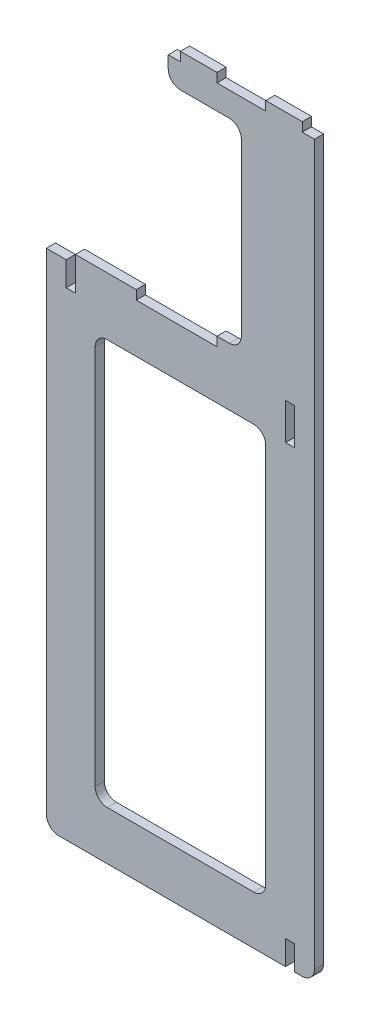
ISO-10303-21;
HEADER;
FILE_DESCRIPTION(('STEP AP214'),'2;1');
FILE_NAME('part.step','',(''),(''),'','','');
FILE_SCHEMA(('AUTOMOTIVE_DESIGN { 1 0 10303 214 1 1 1 1 }'));
ENDSEC;
DATA;
#1=APPLICATION_CONTEXT('core data for automotive mechanical design processes');
#2=APPLICATION_PROTOCOL_DEFINITION('international standard','automotive_design',2000,#1);
#3=PRODUCT_CONTEXT('',#1,'mechanical');
#4=PRODUCT('Part','Part','',(#3));
#5=PRODUCT_RELATED_PRODUCT_CATEGORY('part','',(#4));
#6=PRODUCT_DEFINITION_FORMATION('','',#4);
#7=PRODUCT_DEFINITION_CONTEXT('part definition',#1,'design');
#8=PRODUCT_DEFINITION('design','',#6,#7);
#9=PRODUCT_DEFINITION_SHAPE('','',#8);
#10=(LENGTH_UNIT() NAMED_UNIT(*) SI_UNIT(.MILLI.,.METRE.));
#11=(NAMED_UNIT(*) PLANE_ANGLE_UNIT() SI_UNIT($,.RADIAN.));
#12=(NAMED_UNIT(*) SI_UNIT($,.STERADIAN.) SOLID_ANGLE_UNIT());
#13=UNCERTAINTY_MEASURE_WITH_UNIT(LENGTH_MEASURE(1.E-05),#10,'distance_accuracy_value','');
#14=(GEOMETRIC_REPRESENTATION_CONTEXT(3) GLOBAL_UNCERTAINTY_ASSIGNED_CONTEXT((#13)) GLOBAL_UNIT_ASSIGNED_CONTEXT((#10,
#11,#12)) REPRESENTATION_CONTEXT('',''));
#15=CARTESIAN_POINT('',(0.,0.,0.));
#16=DIRECTION('',(0.,0.,1.));
#17=DIRECTION('',(1.,0.,0.));
#18=AXIS2_PLACEMENT_3D('',#15,#16,#17);
#19=CARTESIAN_POINT('',(279.4,1000.125,-309.00433653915));
#20=DIRECTION('',(0.,1.,0.));
#21=DIRECTION('',(0.,0.,1.));
#22=AXIS2_PLACEMENT_3D('',#19,#20,#21);
#23=PLANE('',#22);
#24=DIRECTION('',(0.,0.,1.));
#25=VECTOR('',#24,1.);
#26=CARTESIAN_POINT('',(177.8,1000.125,-78.5451621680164));
#27=LINE('',#26,#25);
#28=CARTESIAN_POINT('',(177.8,1000.125,0.));
#29=VERTEX_POINT('',#28);
#30=CARTESIAN_POINT('',(177.8,1000.125,19.05));
#31=VERTEX_POINT('',#30);
#32=EDGE_CURVE('E374',#29,#31,#27,.T.);
#33=ORIENTED_EDGE('',*,*,#32,.F.);
#34=DIRECTION('',(1.,0.,0.));
#35=VECTOR('',#34,1.);
#36=CARTESIAN_POINT('',(279.4,1000.125,0.));
#37=LINE('',#36,#35);
#38=CARTESIAN_POINT('',(76.2000000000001,1000.125,0.));
#39=VERTEX_POINT('',#38);
#40=EDGE_CURVE('E413',#39,#29,#37,.T.);
#41=ORIENTED_EDGE('',*,*,#40,.F.);
#42=DIRECTION('',(0.,0.,1.));
#43=VECTOR('',#42,1.);
#44=CARTESIAN_POINT('',(76.2000000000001,1000.125,-78.5451621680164));
#45=LINE('',#44,#43);
#46=CARTESIAN_POINT('',(76.2000000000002,1000.125,19.05));
#47=VERTEX_POINT('',#46);
#48=EDGE_CURVE('E395',#39,#47,#45,.T.);
#49=ORIENTED_EDGE('',*,*,#48,.T.);
#50=DIRECTION('',(-1.,0.,0.));
#51=VECTOR('',#50,1.);
#52=CARTESIAN_POINT('',(279.4,1000.125,19.05));
#53=LINE('',#52,#51);
#54=EDGE_CURVE('E415',#31,#47,#53,.T.);
#55=ORIENTED_EDGE('',*,*,#54,.F.);
#56=EDGE_LOOP('',(#33,#41,#49,#55));
#57=FACE_BOUND('',#56,.T.);
#58=ADVANCED_FACE('F41',(#57),#23,.T.);
#59=DIRECTION('',(0.,0.,1.));
#60=VECTOR('',#59,1.);
#61=CARTESIAN_POINT('',(254.,1000.125,-78.5451621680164));
#62=LINE('',#61,#60);
#63=CARTESIAN_POINT('',(254.,1000.125,0.));
#64=VERTEX_POINT('',#63);
#65=CARTESIAN_POINT('',(254.,1000.125,19.05));
#66=VERTEX_POINT('',#65);
#67=EDGE_CURVE('E378',#64,#66,#62,.T.);
#68=ORIENTED_EDGE('',*,*,#67,.T.);
#69=CARTESIAN_POINT('',(279.4,1000.125,19.05));
#70=VERTEX_POINT('',#69);
#71=EDGE_CURVE('E489',#70,#66,#53,.T.);
#72=ORIENTED_EDGE('',*,*,#71,.F.);
#73=DIRECTION('',(0.,0.,1.));
#74=VECTOR('',#73,1.);
#75=CARTESIAN_POINT('',(279.4,1000.125,-309.00433653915));
#76=LINE('',#75,#74);
#77=CARTESIAN_POINT('',(279.4,1000.125,0.));
#78=VERTEX_POINT('',#77);
#79=EDGE_CURVE('E421',#78,#70,#76,.T.);
#80=ORIENTED_EDGE('',*,*,#79,.F.);
#81=EDGE_CURVE('E410',#64,#78,#37,.T.);
#82=ORIENTED_EDGE('',*,*,#81,.F.);
#83=EDGE_LOOP('',(#68,#72,#80,#82));
#84=FACE_BOUND('',#83,.T.);
#85=ADVANCED_FACE('F532',(#84),#23,.T.);
#86=CARTESIAN_POINT('',(-279.4,523.875,19.05));
#87=DIRECTION('',(0.,-1.,0.));
#88=DIRECTION('',(0.,0.,-1.));
#89=AXIS2_PLACEMENT_3D('',#86,#87,#88);
#90=PLANE('',#89);
#91=DIRECTION('',(0.,0.,1.));
#92=VECTOR('',#91,1.);
#93=CARTESIAN_POINT('',(76.1999999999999,523.875,-471.484827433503));
#94=LINE('',#93,#92);
#95=CARTESIAN_POINT('',(76.1999999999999,523.875,0.));
#96=VERTEX_POINT('',#95);
#97=CARTESIAN_POINT('',(76.1999999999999,523.875,19.05));
#98=VERTEX_POINT('',#97);
#99=EDGE_CURVE('E732',#96,#98,#94,.T.);
#100=ORIENTED_EDGE('',*,*,#99,.F.);
#101=DIRECTION('',(-1.,0.,0.));
#102=VECTOR('',#101,1.);
#103=CARTESIAN_POINT('',(-279.4,523.875,0.));
#104=LINE('',#103,#102);
#105=CARTESIAN_POINT('',(-92.0750000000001,523.875,0.));
#106=VERTEX_POINT('',#105);
#107=EDGE_CURVE('E548',#96,#106,#104,.T.);
#108=ORIENTED_EDGE('',*,*,#107,.T.);
#109=DIRECTION('',(0.,0.,1.));
#110=VECTOR('',#109,1.);
#111=CARTESIAN_POINT('',(-92.0750000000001,523.875,-128.420802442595));
#112=LINE('',#111,#110);
#113=CARTESIAN_POINT('',(-92.0750000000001,523.875,19.05));
#114=VERTEX_POINT('',#113);
#115=EDGE_CURVE('E648',#106,#114,#112,.T.);
#116=ORIENTED_EDGE('',*,*,#115,.T.);
#117=DIRECTION('',(-1.,0.,0.));
#118=VECTOR('',#117,1.);
#119=CARTESIAN_POINT('',(-279.4,523.875,19.05));
#120=LINE('',#119,#118);
#121=EDGE_CURVE('E598',#98,#114,#120,.T.);
#122=ORIENTED_EDGE('',*,*,#121,.F.);
#123=EDGE_LOOP('',(#100,#108,#116,#122));
#124=FACE_BOUND('',#123,.T.);
#125=ADVANCED_FACE('F706',(#124),#90,.F.);
#126=CARTESIAN_POINT('',(-279.4,-523.875,19.05));
#127=DIRECTION('',(0.,1.,0.));
#128=DIRECTION('',(0.,0.,1.));
#129=AXIS2_PLACEMENT_3D('',#126,#127,#128);
#130=PLANE('',#129);
#131=DIRECTION('',(1.,0.,0.));
#132=VECTOR('',#131,1.);
#133=CARTESIAN_POINT('',(-279.4,-523.875,0.));
#134=LINE('',#133,#132);
#135=CARTESIAN_POINT('',(-254.,-523.875,0.));
#136=VERTEX_POINT('',#135);
#137=CARTESIAN_POINT('',(219.075,-523.875,0.));
#138=VERTEX_POINT('',#137);
#139=EDGE_CURVE('E561',#136,#138,#134,.T.);
#140=ORIENTED_EDGE('',*,*,#139,.T.);
#141=DIRECTION('',(0.,0.,1.));
#142=VECTOR('',#141,1.);
#143=CARTESIAN_POINT('',(219.075,-523.875,0.));
#144=LINE('',#143,#142);
#145=CARTESIAN_POINT('',(219.075,-523.875,19.05));
#146=VERTEX_POINT('',#145);
#147=EDGE_CURVE('E623',#138,#146,#144,.T.);
#148=ORIENTED_EDGE('',*,*,#147,.T.);
#149=DIRECTION('',(1.,0.,0.));
#150=VECTOR('',#149,1.);
#151=CARTESIAN_POINT('',(-279.4,-523.875,19.05));
#152=LINE('',#151,#150);
#153=CARTESIAN_POINT('',(-254.,-523.875,19.05));
#154=VERTEX_POINT('',#153);
#155=EDGE_CURVE('E554',#154,#146,#152,.T.);
#156=ORIENTED_EDGE('',*,*,#155,.F.);
#157=DIRECTION('',(0.,0.,-1.));
#158=VECTOR('',#157,1.);
#159=CARTESIAN_POINT('',(-254.,-523.875,19.05));
#160=LINE('',#159,#158);
#161=EDGE_CURVE('E573',#154,#136,#160,.T.);
#162=ORIENTED_EDGE('',*,*,#161,.T.);
#163=EDGE_LOOP('',(#140,#148,#156,#162));
#164=FACE_BOUND('',#163,.T.);
#165=ADVANCED_FACE('F603',(#164),#130,.F.);
#166=CARTESIAN_POINT('',(-238.125,523.875,19.05));
#167=VERTEX_POINT('',#166);
#168=CARTESIAN_POINT('',(-279.4,523.875,19.05));
#169=VERTEX_POINT('',#168);
#170=EDGE_CURVE('E595',#167,#169,#120,.T.);
#171=ORIENTED_EDGE('',*,*,#170,.F.);
#172=DIRECTION('',(0.,0.,1.));
#173=VECTOR('',#172,1.);
#174=CARTESIAN_POINT('',(-238.125,523.875,0.));
#175=LINE('',#174,#173);
#176=CARTESIAN_POINT('',(-238.125,523.875,0.));
#177=VERTEX_POINT('',#176);
#178=EDGE_CURVE('E671',#177,#167,#175,.T.);
#179=ORIENTED_EDGE('',*,*,#178,.F.);
#180=CARTESIAN_POINT('',(-279.4,523.875,0.));
#181=VERTEX_POINT('',#180);
#182=EDGE_CURVE('E545',#177,#181,#104,.T.);
#183=ORIENTED_EDGE('',*,*,#182,.T.);
#184=DIRECTION('',(0.,0.,-1.));
#185=VECTOR('',#184,1.);
#186=CARTESIAN_POINT('',(-279.4,523.875,19.05));
#187=LINE('',#186,#185);
#188=EDGE_CURVE('E565',#169,#181,#187,.T.);
#189=ORIENTED_EDGE('',*,*,#188,.F.);
#190=EDGE_LOOP('',(#171,#179,#183,#189));
#191=FACE_BOUND('',#190,.T.);
#192=ADVANCED_FACE('F727',(#191),#90,.F.);
#193=CARTESIAN_POINT('',(279.4,523.875,19.05));
#194=DIRECTION('',(-1.,0.,0.));
#195=DIRECTION('',(0.,-1.,0.));
#196=AXIS2_PLACEMENT_3D('',#193,#194,#195);
#197=PLANE('',#196);
#198=DIRECTION('',(0.,1.,0.));
#199=VECTOR('',#198,1.);
#200=CARTESIAN_POINT('',(279.4,523.875,19.05));
#201=LINE('',#200,#199);
#202=CARTESIAN_POINT('',(279.4,-498.475,19.05));
#203=VERTEX_POINT('',#202);
#204=EDGE_CURVE('E564',#203,#70,#201,.T.);
#205=ORIENTED_EDGE('',*,*,#204,.F.);
#206=DIRECTION('',(0.,0.,-1.));
#207=VECTOR('',#206,1.);
#208=CARTESIAN_POINT('',(279.4,-498.475,19.05));
#209=LINE('',#208,#207);
#210=CARTESIAN_POINT('',(279.4,-498.475,0.));
#211=VERTEX_POINT('',#210);
#212=EDGE_CURVE('E544',#203,#211,#209,.T.);
#213=ORIENTED_EDGE('',*,*,#212,.T.);
#214=DIRECTION('',(0.,1.,0.));
#215=VECTOR('',#214,1.);
#216=CARTESIAN_POINT('',(279.4,523.875,0.));
#217=LINE('',#216,#215);
#218=EDGE_CURVE('E538',#211,#78,#217,.T.);
#219=ORIENTED_EDGE('',*,*,#218,.T.);
#220=ORIENTED_EDGE('',*,*,#79,.T.);
#221=EDGE_LOOP('',(#205,#213,#219,#220));
#222=FACE_BOUND('',#221,.T.);
#223=ADVANCED_FACE('F542',(#222),#197,.F.);
#224=CARTESIAN_POINT('',(-279.4,523.875,19.05));
#225=DIRECTION('',(1.,0.,0.));
#226=DIRECTION('',(0.,1.,0.));
#227=AXIS2_PLACEMENT_3D('',#224,#225,#226);
#228=PLANE('',#227);
#229=DIRECTION('',(0.,-1.,0.));
#230=VECTOR('',#229,1.);
#231=CARTESIAN_POINT('',(-279.4,523.875,0.));
#232=LINE('',#231,#230);
#233=CARTESIAN_POINT('',(-279.4,-498.475,0.));
#234=VERTEX_POINT('',#233);
#235=EDGE_CURVE('E557',#181,#234,#232,.T.);
#236=ORIENTED_EDGE('',*,*,#235,.T.);
#237=DIRECTION('',(0.,0.,-1.));
#238=VECTOR('',#237,1.);
#239=CARTESIAN_POINT('',(-279.4,-498.475,19.05));
#240=LINE('',#239,#238);
#241=CARTESIAN_POINT('',(-279.4,-498.475,19.05));
#242=VERTEX_POINT('',#241);
#243=EDGE_CURVE('E466',#234,#242,#240,.F.);
#244=ORIENTED_EDGE('',*,*,#243,.T.);
#245=DIRECTION('',(0.,-1.,0.));
#246=VECTOR('',#245,1.);
#247=CARTESIAN_POINT('',(-279.4,523.875,19.05));
#248=LINE('',#247,#246);
#249=EDGE_CURVE('E587',#169,#242,#248,.T.);
#250=ORIENTED_EDGE('',*,*,#249,.F.);
#251=ORIENTED_EDGE('',*,*,#188,.T.);
#252=EDGE_LOOP('',(#236,#244,#250,#251));
#253=FACE_BOUND('',#252,.T.);
#254=ADVANCED_FACE('F586',(#253),#228,.F.);
#255=CARTESIAN_POINT('',(238.125,-523.875,19.05));
#256=VERTEX_POINT('',#255);
#257=CARTESIAN_POINT('',(254.,-523.875,19.05));
#258=VERTEX_POINT('',#257);
#259=EDGE_CURVE('E597',#256,#258,#152,.T.);
#260=ORIENTED_EDGE('',*,*,#259,.F.);
#261=DIRECTION('',(0.,0.,1.));
#262=VECTOR('',#261,1.);
#263=CARTESIAN_POINT('',(238.125,-523.875,0.));
#264=LINE('',#263,#262);
#265=CARTESIAN_POINT('',(238.125,-523.875,0.));
#266=VERTEX_POINT('',#265);
#267=EDGE_CURVE('E633',#266,#256,#264,.T.);
#268=ORIENTED_EDGE('',*,*,#267,.F.);
#269=CARTESIAN_POINT('',(254.,-523.875,0.));
#270=VERTEX_POINT('',#269);
#271=EDGE_CURVE('E560',#266,#270,#134,.T.);
#272=ORIENTED_EDGE('',*,*,#271,.T.);
#273=DIRECTION('',(0.,0.,-1.));
#274=VECTOR('',#273,1.);
#275=CARTESIAN_POINT('',(254.,-523.875,19.05));
#276=LINE('',#275,#274);
#277=EDGE_CURVE('E576',#270,#258,#276,.F.);
#278=ORIENTED_EDGE('',*,*,#277,.T.);
#279=EDGE_LOOP('',(#260,#268,#272,#278));
#280=FACE_BOUND('',#279,.T.);
#281=ADVANCED_FACE('F861',(#280),#130,.F.);
#282=CARTESIAN_POINT('',(0.,0.,19.05));
#283=DIRECTION('',(0.,0.,1.));
#284=DIRECTION('',(1.,0.,0.));
#285=AXIS2_PLACEMENT_3D('',#282,#283,#284);
#286=PLANE('',#285);
#287=DIRECTION('',(0.,-1.,0.));
#288=VECTOR('',#287,1.);
#289=CARTESIAN_POINT('',(219.075,498.475,19.05));
#290=LINE('',#289,#288);
#291=CARTESIAN_POINT('',(219.075,498.475,19.05));
#292=VERTEX_POINT('',#291);
#293=CARTESIAN_POINT('',(219.075,422.275,19.05));
#294=VERTEX_POINT('',#293);
#295=EDGE_CURVE('E56',#292,#294,#290,.T.);
#296=ORIENTED_EDGE('',*,*,#295,.F.);
#297=DIRECTION('',(-1.,0.,0.));
#298=VECTOR('',#297,1.);
#299=CARTESIAN_POINT('',(219.075,498.475,19.05));
#300=LINE('',#299,#298);
#301=CARTESIAN_POINT('',(238.125,498.475,19.05));
#302=VERTEX_POINT('',#301);
#303=EDGE_CURVE('E347',#302,#292,#300,.T.);
#304=ORIENTED_EDGE('',*,*,#303,.F.);
#305=DIRECTION('',(0.,1.,0.));
#306=VECTOR('',#305,1.);
#307=CARTESIAN_POINT('',(238.125,498.475,19.05));
#308=LINE('',#307,#306);
#309=CARTESIAN_POINT('',(238.125,422.275,19.05));
#310=VERTEX_POINT('',#309);
#311=EDGE_CURVE('E331',#310,#302,#308,.T.);
#312=ORIENTED_EDGE('',*,*,#311,.F.);
#313=DIRECTION('',(1.,0.,0.));
#314=VECTOR('',#313,1.);
#315=CARTESIAN_POINT('',(219.075,422.275,19.05));
#316=LINE('',#315,#314);
#317=EDGE_CURVE('E340',#294,#310,#316,.T.);
#318=ORIENTED_EDGE('',*,*,#317,.F.);
#319=EDGE_LOOP('',(#296,#304,#312,#318));
#320=FACE_BOUND('',#319,.T.);
#321=DIRECTION('',(0.,-1.,0.));
#322=VECTOR('',#321,1.);
#323=CARTESIAN_POINT('',(-25.3999999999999,949.325,19.05));
#324=LINE('',#323,#322);
#325=CARTESIAN_POINT('',(-25.3999999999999,1000.125,19.05));
#326=VERTEX_POINT('',#325);
#327=CARTESIAN_POINT('',(-25.3999999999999,974.725,19.05));
#328=VERTEX_POINT('',#327);
#329=EDGE_CURVE('E483',#326,#328,#324,.T.);
#330=ORIENTED_EDGE('',*,*,#329,.T.);
#331=CARTESIAN_POINT('',(0.,974.725,19.05));
#332=DIRECTION('',(0.,0.,1.));
#333=DIRECTION('',(1.,0.,0.));
#334=AXIS2_PLACEMENT_3D('',#331,#332,#333);
#335=CIRCLE('',#334,25.4);
#336=CARTESIAN_POINT('',(0.,949.325,19.05));
#337=VERTEX_POINT('',#336);
#338=EDGE_CURVE('E441',#328,#337,#335,.T.);
#339=ORIENTED_EDGE('',*,*,#338,.T.);
#340=DIRECTION('',(1.,0.,0.));
#341=VECTOR('',#340,1.);
#342=CARTESIAN_POINT('',(279.4,949.325,19.05));
#343=LINE('',#342,#341);
#344=CARTESIAN_POINT('',(101.6,949.325,19.05));
#345=VERTEX_POINT('',#344);
#346=EDGE_CURVE('E478',#337,#345,#343,.T.);
#347=ORIENTED_EDGE('',*,*,#346,.T.);
#348=CARTESIAN_POINT('',(101.6,923.925,19.05));
#349=DIRECTION('',(0.,0.,1.));
#350=DIRECTION('',(1.,0.,0.));
#351=AXIS2_PLACEMENT_3D('',#348,#349,#350);
#352=CIRCLE('',#351,25.4);
#353=CARTESIAN_POINT('',(127.,923.925,19.05));
#354=VERTEX_POINT('',#353);
#355=EDGE_CURVE('E437',#345,#354,#352,.F.);
#356=ORIENTED_EDGE('',*,*,#355,.T.);
#357=DIRECTION('',(0.,1.,0.));
#358=VECTOR('',#357,1.);
#359=CARTESIAN_POINT('',(127.,0.,19.05));
#360=LINE('',#359,#358);
#361=CARTESIAN_POINT('',(127.,568.325,19.05));
#362=VERTEX_POINT('',#361);
#363=EDGE_CURVE('E433',#362,#354,#360,.T.);
#364=ORIENTED_EDGE('',*,*,#363,.F.);
#365=CARTESIAN_POINT('',(101.6,568.325,19.05));
#366=DIRECTION('',(0.,0.,1.));
#367=DIRECTION('',(1.,0.,0.));
#368=AXIS2_PLACEMENT_3D('',#365,#366,#367);
#369=CIRCLE('',#368,25.4);
#370=CARTESIAN_POINT('',(101.6,542.925,19.05));
#371=VERTEX_POINT('',#370);
#372=EDGE_CURVE('E468',#362,#371,#369,.F.);
#373=ORIENTED_EDGE('',*,*,#372,.T.);
#374=DIRECTION('',(-1.,0.,0.));
#375=VECTOR('',#374,1.);
#376=CARTESIAN_POINT('',(0.,542.925,19.05));
#377=LINE('',#376,#375);
#378=CARTESIAN_POINT('',(76.1999999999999,542.925,19.05));
#379=VERTEX_POINT('',#378);
#380=EDGE_CURVE('E461',#371,#379,#377,.T.);
#381=ORIENTED_EDGE('',*,*,#380,.T.);
#382=DIRECTION('',(0.,1.,0.));
#383=VECTOR('',#382,1.);
#384=CARTESIAN_POINT('',(76.1999999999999,0.,19.05));
#385=LINE('',#384,#383);
#386=EDGE_CURVE('E701',#98,#379,#385,.T.);
#387=ORIENTED_EDGE('',*,*,#386,.F.);
#388=ORIENTED_EDGE('',*,*,#121,.T.);
#389=DIRECTION('',(0.,1.,0.));
#390=VECTOR('',#389,1.);
#391=CARTESIAN_POINT('',(-92.0750000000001,523.875,19.05));
#392=LINE('',#391,#390);
#393=CARTESIAN_POINT('',(-92.0750000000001,542.925,19.05));
#394=VERTEX_POINT('',#393);
#395=EDGE_CURVE('E630',#114,#394,#392,.T.);
#396=ORIENTED_EDGE('',*,*,#395,.T.);
#397=DIRECTION('',(-1.,0.,0.));
#398=VECTOR('',#397,1.);
#399=CARTESIAN_POINT('',(-219.075,542.925,19.05));
#400=LINE('',#399,#398);
#401=CARTESIAN_POINT('',(-219.075,542.925,19.05));
#402=VERTEX_POINT('',#401);
#403=EDGE_CURVE('E645',#394,#402,#400,.T.);
#404=ORIENTED_EDGE('',*,*,#403,.T.);
#405=DIRECTION('',(0.,1.,0.));
#406=VECTOR('',#405,1.);
#407=CARTESIAN_POINT('',(-219.075,523.875,19.05));
#408=LINE('',#407,#406);
#409=CARTESIAN_POINT('',(-219.075,473.075,19.05));
#410=VERTEX_POINT('',#409);
#411=EDGE_CURVE('E659',#410,#402,#408,.T.);
#412=ORIENTED_EDGE('',*,*,#411,.F.);
#413=DIRECTION('',(1.,0.,0.));
#414=VECTOR('',#413,1.);
#415=CARTESIAN_POINT('',(-238.125,473.075,19.05));
#416=LINE('',#415,#414);
#417=CARTESIAN_POINT('',(-238.125,473.075,19.05));
#418=VERTEX_POINT('',#417);
#419=EDGE_CURVE('E667',#418,#410,#416,.T.);
#420=ORIENTED_EDGE('',*,*,#419,.F.);
#421=DIRECTION('',(0.,-1.,0.));
#422=VECTOR('',#421,1.);
#423=CARTESIAN_POINT('',(-238.125,523.875,19.05));
#424=LINE('',#423,#422);
#425=EDGE_CURVE('E642',#167,#418,#424,.T.);
#426=ORIENTED_EDGE('',*,*,#425,.F.);
#427=ORIENTED_EDGE('',*,*,#170,.T.);
#428=ORIENTED_EDGE('',*,*,#249,.T.);
#429=CARTESIAN_POINT('',(-254.,-498.475,19.05));
#430=DIRECTION('',(0.,0.,1.));
#431=DIRECTION('',(1.,0.,0.));
#432=AXIS2_PLACEMENT_3D('',#429,#430,#431);
#433=CIRCLE('',#432,25.4);
#434=EDGE_CURVE('E579',#242,#154,#433,.T.);
#435=ORIENTED_EDGE('',*,*,#434,.T.);
#436=ORIENTED_EDGE('',*,*,#155,.T.);
#437=DIRECTION('',(0.,-1.,0.));
#438=VECTOR('',#437,1.);
#439=CARTESIAN_POINT('',(219.075,-523.875,19.05));
#440=LINE('',#439,#438);
#441=CARTESIAN_POINT('',(219.075,-473.075,19.05));
#442=VERTEX_POINT('',#441);
#443=EDGE_CURVE('E624',#442,#146,#440,.T.);
#444=ORIENTED_EDGE('',*,*,#443,.F.);
#445=DIRECTION('',(-1.,0.,0.));
#446=VECTOR('',#445,1.);
#447=CARTESIAN_POINT('',(219.075,-473.075,19.05));
#448=LINE('',#447,#446);
#449=CARTESIAN_POINT('',(238.125,-473.075,19.05));
#450=VERTEX_POINT('',#449);
#451=EDGE_CURVE('E613',#450,#442,#448,.T.);
#452=ORIENTED_EDGE('',*,*,#451,.F.);
#453=DIRECTION('',(0.,1.,0.));
#454=VECTOR('',#453,1.);
#455=CARTESIAN_POINT('',(238.125,-523.875,19.05));
#456=LINE('',#455,#454);
#457=EDGE_CURVE('E617',#256,#450,#456,.T.);
#458=ORIENTED_EDGE('',*,*,#457,.F.);
#459=ORIENTED_EDGE('',*,*,#259,.T.);
#460=CARTESIAN_POINT('',(254.,-498.475,19.05));
#461=DIRECTION('',(0.,0.,1.));
#462=DIRECTION('',(1.,0.,0.));
#463=AXIS2_PLACEMENT_3D('',#460,#461,#462);
#464=CIRCLE('',#463,25.4);
#465=EDGE_CURVE('E581',#258,#203,#464,.T.);
#466=ORIENTED_EDGE('',*,*,#465,.T.);
#467=ORIENTED_EDGE('',*,*,#204,.T.);
#468=ORIENTED_EDGE('',*,*,#71,.T.);
#469=DIRECTION('',(0.,1.,0.));
#470=VECTOR('',#469,1.);
#471=CARTESIAN_POINT('',(254.,1000.125,19.05));
#472=LINE('',#471,#470);
#473=CARTESIAN_POINT('',(254.,1019.175,19.05));
#474=VERTEX_POINT('',#473);
#475=EDGE_CURVE('E368',#66,#474,#472,.T.);
#476=ORIENTED_EDGE('',*,*,#475,.T.);
#477=DIRECTION('',(-1.,0.,0.));
#478=VECTOR('',#477,1.);
#479=CARTESIAN_POINT('',(177.8,1019.175,19.05));
#480=LINE('',#479,#478);
#481=CARTESIAN_POINT('',(177.8,1019.175,19.05));
#482=VERTEX_POINT('',#481);
#483=EDGE_CURVE('E371',#474,#482,#480,.T.);
#484=ORIENTED_EDGE('',*,*,#483,.T.);
#485=DIRECTION('',(0.,-1.,0.));
#486=VECTOR('',#485,1.);
#487=CARTESIAN_POINT('',(177.8,1000.125,19.05));
#488=LINE('',#487,#486);
#489=EDGE_CURVE('E354',#482,#31,#488,.T.);
#490=ORIENTED_EDGE('',*,*,#489,.T.);
#491=ORIENTED_EDGE('',*,*,#54,.T.);
#492=DIRECTION('',(0.,1.,0.));
#493=VECTOR('',#492,1.);
#494=CARTESIAN_POINT('',(76.2000000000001,1000.125,19.05));
#495=LINE('',#494,#493);
#496=CARTESIAN_POINT('',(76.2000000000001,1019.175,19.05));
#497=VERTEX_POINT('',#496);
#498=EDGE_CURVE('E390',#47,#497,#495,.T.);
#499=ORIENTED_EDGE('',*,*,#498,.T.);
#500=DIRECTION('',(-1.,0.,0.));
#501=VECTOR('',#500,1.);
#502=CARTESIAN_POINT('',(0.,1019.175,19.05));
#503=LINE('',#502,#501);
#504=CARTESIAN_POINT('',(0.,1019.175,19.05));
#505=VERTEX_POINT('',#504);
#506=EDGE_CURVE('E386',#497,#505,#503,.T.);
#507=ORIENTED_EDGE('',*,*,#506,.T.);
#508=DIRECTION('',(0.,-1.,0.));
#509=VECTOR('',#508,1.);
#510=CARTESIAN_POINT('',(0.,1000.125,19.05));
#511=LINE('',#510,#509);
#512=CARTESIAN_POINT('',(0.,1000.125,19.05));
#513=VERTEX_POINT('',#512);
#514=EDGE_CURVE('E365',#505,#513,#511,.T.);
#515=ORIENTED_EDGE('',*,*,#514,.T.);
#516=EDGE_CURVE('E487',#513,#326,#53,.T.);
#517=ORIENTED_EDGE('',*,*,#516,.T.);
#518=EDGE_LOOP('',(#330,#339,#347,#356,#364,#373,#381,#387,#388,#396,#404,#412,#420,#426,#427,
#428,#435,#436,#444,#452,#458,#459,#466,#467,#468,#476,#484,#490,#491,#499,#507,#515,#517));
#519=FACE_BOUND('',#518,.T.);
#520=DIRECTION('',(0.,1.,0.));
#521=VECTOR('',#520,1.);
#522=CARTESIAN_POINT('',(177.8,422.275,19.05));
#523=LINE('',#522,#521);
#524=CARTESIAN_POINT('',(177.8,-396.875,19.05));
#525=VERTEX_POINT('',#524);
#526=CARTESIAN_POINT('',(177.8,396.875,19.05));
#527=VERTEX_POINT('',#526);
#528=EDGE_CURVE('E673',#525,#527,#523,.T.);
#529=ORIENTED_EDGE('',*,*,#528,.F.);
#530=CARTESIAN_POINT('',(152.4,-396.875,19.05));
#531=DIRECTION('',(0.,0.,1.));
#532=DIRECTION('',(1.,0.,0.));
#533=AXIS2_PLACEMENT_3D('',#530,#531,#532);
#534=CIRCLE('',#533,25.4);
#535=CARTESIAN_POINT('',(152.4,-422.275,19.05));
#536=VERTEX_POINT('',#535);
#537=EDGE_CURVE('E1276',#525,#536,#534,.F.);
#538=ORIENTED_EDGE('',*,*,#537,.T.);
#539=DIRECTION('',(1.,0.,0.));
#540=VECTOR('',#539,1.);
#541=CARTESIAN_POINT('',(-177.8,-422.275,19.05));
#542=LINE('',#541,#540);
#543=CARTESIAN_POINT('',(-152.4,-422.275,19.05));
#544=VERTEX_POINT('',#543);
#545=EDGE_CURVE('E681',#544,#536,#542,.T.);
#546=ORIENTED_EDGE('',*,*,#545,.F.);
#547=CARTESIAN_POINT('',(-152.4,-396.875,19.05));
#548=DIRECTION('',(0.,0.,1.));
#549=DIRECTION('',(1.,0.,0.));
#550=AXIS2_PLACEMENT_3D('',#547,#548,#549);
#551=CIRCLE('',#550,25.4);
#552=CARTESIAN_POINT('',(-177.8,-396.875,19.05));
#553=VERTEX_POINT('',#552);
#554=EDGE_CURVE('E906',#544,#553,#551,.F.);
#555=ORIENTED_EDGE('',*,*,#554,.T.);
#556=DIRECTION('',(0.,-1.,0.));
#557=VECTOR('',#556,1.);
#558=CARTESIAN_POINT('',(-177.8,422.275,19.05));
#559=LINE('',#558,#557);
#560=CARTESIAN_POINT('',(-177.8,396.875,19.05));
#561=VERTEX_POINT('',#560);
#562=EDGE_CURVE('E691',#561,#553,#559,.T.);
#563=ORIENTED_EDGE('',*,*,#562,.F.);
#564=CARTESIAN_POINT('',(-152.4,396.875,19.05));
#565=DIRECTION('',(0.,0.,1.));
#566=DIRECTION('',(1.,0.,0.));
#567=AXIS2_PLACEMENT_3D('',#564,#565,#566);
#568=CIRCLE('',#567,25.4);
#569=CARTESIAN_POINT('',(-152.4,422.275,19.05));
#570=VERTEX_POINT('',#569);
#571=EDGE_CURVE('E907',#561,#570,#568,.F.);
#572=ORIENTED_EDGE('',*,*,#571,.T.);
#573=DIRECTION('',(-1.,0.,0.));
#574=VECTOR('',#573,1.);
#575=CARTESIAN_POINT('',(-177.8,422.275,19.05));
#576=LINE('',#575,#574);
#577=CARTESIAN_POINT('',(152.4,422.275,19.05));
#578=VERTEX_POINT('',#577);
#579=EDGE_CURVE('E688',#578,#570,#576,.T.);
#580=ORIENTED_EDGE('',*,*,#579,.F.);
#581=CARTESIAN_POINT('',(152.4,396.875,19.05));
#582=DIRECTION('',(0.,0.,1.));
#583=DIRECTION('',(1.,0.,0.));
#584=AXIS2_PLACEMENT_3D('',#581,#582,#583);
#585=CIRCLE('',#584,25.4);
#586=EDGE_CURVE('E1280',#578,#527,#585,.F.);
#587=ORIENTED_EDGE('',*,*,#586,.T.);
#588=EDGE_LOOP('',(#529,#538,#546,#555,#563,#572,#580,#587));
#589=FACE_BOUND('',#588,.T.);
#590=ADVANCED_FACE('F344',(#320,#519,#589),#286,.T.);
#591=CARTESIAN_POINT('',(0.,0.,0.));
#592=DIRECTION('',(0.,0.,1.));
#593=DIRECTION('',(1.,0.,0.));
#594=AXIS2_PLACEMENT_3D('',#591,#592,#593);
#595=PLANE('',#594);
#596=DIRECTION('',(-1.,0.,0.));
#597=VECTOR('',#596,1.);
#598=CARTESIAN_POINT('',(0.,498.475,0.));
#599=LINE('',#598,#597);
#600=CARTESIAN_POINT('',(238.125,498.475,0.));
#601=VERTEX_POINT('',#600);
#602=CARTESIAN_POINT('',(219.075,498.475,0.));
#603=VERTEX_POINT('',#602);
#604=EDGE_CURVE('E49',#601,#603,#599,.T.);
#605=ORIENTED_EDGE('',*,*,#604,.T.);
#606=DIRECTION('',(0.,-1.,0.));
#607=VECTOR('',#606,1.);
#608=CARTESIAN_POINT('',(219.075,0.,0.));
#609=LINE('',#608,#607);
#610=CARTESIAN_POINT('',(219.075,422.275,0.));
#611=VERTEX_POINT('',#610);
#612=EDGE_CURVE('E11',#603,#611,#609,.T.);
#613=ORIENTED_EDGE('',*,*,#612,.T.);
#614=DIRECTION('',(1.,0.,0.));
#615=VECTOR('',#614,1.);
#616=CARTESIAN_POINT('',(0.,422.275,0.));
#617=LINE('',#616,#615);
#618=CARTESIAN_POINT('',(238.125,422.275,0.));
#619=VERTEX_POINT('',#618);
#620=EDGE_CURVE('E916',#611,#619,#617,.T.);
#621=ORIENTED_EDGE('',*,*,#620,.T.);
#622=DIRECTION('',(0.,1.,0.));
#623=VECTOR('',#622,1.);
#624=CARTESIAN_POINT('',(238.125,0.,0.));
#625=LINE('',#624,#623);
#626=EDGE_CURVE('E334',#619,#601,#625,.T.);
#627=ORIENTED_EDGE('',*,*,#626,.T.);
#628=EDGE_LOOP('',(#605,#613,#621,#627));
#629=FACE_BOUND('',#628,.T.);
#630=DIRECTION('',(-1.,0.,0.));
#631=VECTOR('',#630,1.);
#632=CARTESIAN_POINT('',(279.4,949.325,0.));
#633=LINE('',#632,#631);
#634=CARTESIAN_POINT('',(101.6,949.325,0.));
#635=VERTEX_POINT('',#634);
#636=CARTESIAN_POINT('',(0.,949.325,0.));
#637=VERTEX_POINT('',#636);
#638=EDGE_CURVE('E414',#635,#637,#633,.T.);
#639=ORIENTED_EDGE('',*,*,#638,.T.);
#640=CARTESIAN_POINT('',(0.,974.725,0.));
#641=DIRECTION('',(0.,0.,1.));
#642=DIRECTION('',(1.,0.,0.));
#643=AXIS2_PLACEMENT_3D('',#640,#641,#642);
#644=CIRCLE('',#643,25.4);
#645=CARTESIAN_POINT('',(-25.3999999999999,974.725,0.));
#646=VERTEX_POINT('',#645);
#647=EDGE_CURVE('E439',#637,#646,#644,.F.);
#648=ORIENTED_EDGE('',*,*,#647,.T.);
#649=DIRECTION('',(0.,1.,0.));
#650=VECTOR('',#649,1.);
#651=CARTESIAN_POINT('',(-25.3999999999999,949.325,0.));
#652=LINE('',#651,#650);
#653=CARTESIAN_POINT('',(-25.3999999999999,1000.125,0.));
#654=VERTEX_POINT('',#653);
#655=EDGE_CURVE('E477',#646,#654,#652,.T.);
#656=ORIENTED_EDGE('',*,*,#655,.T.);
#657=CARTESIAN_POINT('',(0.,1000.125,0.));
#658=VERTEX_POINT('',#657);
#659=EDGE_CURVE('E430',#654,#658,#37,.T.);
#660=ORIENTED_EDGE('',*,*,#659,.T.);
#661=DIRECTION('',(0.,1.,0.));
#662=VECTOR('',#661,1.);
#663=CARTESIAN_POINT('',(0.,1000.125,0.));
#664=LINE('',#663,#662);
#665=CARTESIAN_POINT('',(0.,1019.175,0.));
#666=VERTEX_POINT('',#665);
#667=EDGE_CURVE('E384',#658,#666,#664,.T.);
#668=ORIENTED_EDGE('',*,*,#667,.T.);
#669=DIRECTION('',(1.,0.,0.));
#670=VECTOR('',#669,1.);
#671=CARTESIAN_POINT('',(0.,1019.175,0.));
#672=LINE('',#671,#670);
#673=CARTESIAN_POINT('',(76.2000000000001,1019.175,0.));
#674=VERTEX_POINT('',#673);
#675=EDGE_CURVE('E382',#666,#674,#672,.T.);
#676=ORIENTED_EDGE('',*,*,#675,.T.);
#677=DIRECTION('',(0.,-1.,0.));
#678=VECTOR('',#677,1.);
#679=CARTESIAN_POINT('',(76.2000000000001,1000.125,0.));
#680=LINE('',#679,#678);
#681=EDGE_CURVE('E385',#674,#39,#680,.T.);
#682=ORIENTED_EDGE('',*,*,#681,.T.);
#683=ORIENTED_EDGE('',*,*,#40,.T.);
#684=DIRECTION('',(0.,1.,0.));
#685=VECTOR('',#684,1.);
#686=CARTESIAN_POINT('',(177.8,1000.125,0.));
#687=LINE('',#686,#685);
#688=CARTESIAN_POINT('',(177.8,1019.175,0.));
#689=VERTEX_POINT('',#688);
#690=EDGE_CURVE('E363',#29,#689,#687,.T.);
#691=ORIENTED_EDGE('',*,*,#690,.T.);
#692=DIRECTION('',(1.,0.,0.));
#693=VECTOR('',#692,1.);
#694=CARTESIAN_POINT('',(177.8,1019.175,0.));
#695=LINE('',#694,#693);
#696=CARTESIAN_POINT('',(254.,1019.175,0.));
#697=VERTEX_POINT('',#696);
#698=EDGE_CURVE('E360',#689,#697,#695,.T.);
#699=ORIENTED_EDGE('',*,*,#698,.T.);
#700=DIRECTION('',(0.,-1.,0.));
#701=VECTOR('',#700,1.);
#702=CARTESIAN_POINT('',(254.,1000.125,0.));
#703=LINE('',#702,#701);
#704=EDGE_CURVE('E357',#697,#64,#703,.T.);
#705=ORIENTED_EDGE('',*,*,#704,.T.);
#706=ORIENTED_EDGE('',*,*,#81,.T.);
#707=ORIENTED_EDGE('',*,*,#218,.F.);
#708=CARTESIAN_POINT('',(254.,-498.475,0.));
#709=DIRECTION('',(0.,0.,1.));
#710=DIRECTION('',(1.,0.,0.));
#711=AXIS2_PLACEMENT_3D('',#708,#709,#710);
#712=CIRCLE('',#711,25.4);
#713=EDGE_CURVE('E571',#211,#270,#712,.F.);
#714=ORIENTED_EDGE('',*,*,#713,.T.);
#715=ORIENTED_EDGE('',*,*,#271,.F.);
#716=DIRECTION('',(0.,1.,0.));
#717=VECTOR('',#716,1.);
#718=CARTESIAN_POINT('',(238.125,-523.875,0.));
#719=LINE('',#718,#717);
#720=CARTESIAN_POINT('',(238.125,-473.075,0.));
#721=VERTEX_POINT('',#720);
#722=EDGE_CURVE('E612',#266,#721,#719,.T.);
#723=ORIENTED_EDGE('',*,*,#722,.T.);
#724=DIRECTION('',(-1.,0.,0.));
#725=VECTOR('',#724,1.);
#726=CARTESIAN_POINT('',(219.075,-473.075,0.));
#727=LINE('',#726,#725);
#728=CARTESIAN_POINT('',(219.075,-473.075,0.));
#729=VERTEX_POINT('',#728);
#730=EDGE_CURVE('E610',#721,#729,#727,.T.);
#731=ORIENTED_EDGE('',*,*,#730,.T.);
#732=DIRECTION('',(0.,-1.,0.));
#733=VECTOR('',#732,1.);
#734=CARTESIAN_POINT('',(219.075,-523.875,0.));
#735=LINE('',#734,#733);
#736=EDGE_CURVE('E608',#729,#138,#735,.T.);
#737=ORIENTED_EDGE('',*,*,#736,.T.);
#738=ORIENTED_EDGE('',*,*,#139,.F.);
#739=CARTESIAN_POINT('',(-254.,-498.475,0.));
#740=DIRECTION('',(0.,0.,1.));
#741=DIRECTION('',(1.,0.,0.));
#742=AXIS2_PLACEMENT_3D('',#739,#740,#741);
#743=CIRCLE('',#742,25.4);
#744=EDGE_CURVE('E569',#136,#234,#743,.F.);
#745=ORIENTED_EDGE('',*,*,#744,.T.);
#746=ORIENTED_EDGE('',*,*,#235,.F.);
#747=ORIENTED_EDGE('',*,*,#182,.F.);
#748=DIRECTION('',(0.,-1.,0.));
#749=VECTOR('',#748,1.);
#750=CARTESIAN_POINT('',(-238.125,523.875,0.));
#751=LINE('',#750,#749);
#752=CARTESIAN_POINT('',(-238.125,473.075,0.));
#753=VERTEX_POINT('',#752);
#754=EDGE_CURVE('E655',#177,#753,#751,.T.);
#755=ORIENTED_EDGE('',*,*,#754,.T.);
#756=DIRECTION('',(1.,0.,0.));
#757=VECTOR('',#756,1.);
#758=CARTESIAN_POINT('',(-238.125,473.075,0.));
#759=LINE('',#758,#757);
#760=CARTESIAN_POINT('',(-219.075,473.075,0.));
#761=VERTEX_POINT('',#760);
#762=EDGE_CURVE('E658',#753,#761,#759,.T.);
#763=ORIENTED_EDGE('',*,*,#762,.T.);
#764=DIRECTION('',(0.,1.,0.));
#765=VECTOR('',#764,1.);
#766=CARTESIAN_POINT('',(-219.075,523.875,0.));
#767=LINE('',#766,#765);
#768=CARTESIAN_POINT('',(-219.075,542.925,0.));
#769=VERTEX_POINT('',#768);
#770=EDGE_CURVE('E662',#761,#769,#767,.T.);
#771=ORIENTED_EDGE('',*,*,#770,.T.);
#772=DIRECTION('',(1.,0.,0.));
#773=VECTOR('',#772,1.);
#774=CARTESIAN_POINT('',(-219.075,542.925,0.));
#775=LINE('',#774,#773);
#776=CARTESIAN_POINT('',(-92.0750000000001,542.925,0.));
#777=VERTEX_POINT('',#776);
#778=EDGE_CURVE('E639',#769,#777,#775,.T.);
#779=ORIENTED_EDGE('',*,*,#778,.T.);
#780=DIRECTION('',(0.,-1.,0.));
#781=VECTOR('',#780,1.);
#782=CARTESIAN_POINT('',(-92.0750000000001,523.875,0.));
#783=LINE('',#782,#781);
#784=EDGE_CURVE('E636',#777,#106,#783,.T.);
#785=ORIENTED_EDGE('',*,*,#784,.T.);
#786=ORIENTED_EDGE('',*,*,#107,.F.);
#787=DIRECTION('',(0.,-1.,0.));
#788=VECTOR('',#787,1.);
#789=CARTESIAN_POINT('',(76.1999999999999,0.,0.));
#790=LINE('',#789,#788);
#791=CARTESIAN_POINT('',(76.1999999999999,542.925,-1.11022302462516E-13));
#792=VERTEX_POINT('',#791);
#793=EDGE_CURVE('E423',#792,#96,#790,.T.);
#794=ORIENTED_EDGE('',*,*,#793,.F.);
#795=DIRECTION('',(1.,0.,0.));
#796=VECTOR('',#795,1.);
#797=CARTESIAN_POINT('',(0.,542.925,0.));
#798=LINE('',#797,#796);
#799=CARTESIAN_POINT('',(101.6,542.925,0.));
#800=VERTEX_POINT('',#799);
#801=EDGE_CURVE('E452',#792,#800,#798,.T.);
#802=ORIENTED_EDGE('',*,*,#801,.T.);
#803=CARTESIAN_POINT('',(101.6,568.325,0.));
#804=DIRECTION('',(0.,0.,1.));
#805=DIRECTION('',(1.,0.,0.));
#806=AXIS2_PLACEMENT_3D('',#803,#804,#805);
#807=CIRCLE('',#806,25.4);
#808=CARTESIAN_POINT('',(127.,568.325,0.));
#809=VERTEX_POINT('',#808);
#810=EDGE_CURVE('E470',#800,#809,#807,.T.);
#811=ORIENTED_EDGE('',*,*,#810,.T.);
#812=DIRECTION('',(0.,-1.,0.));
#813=VECTOR('',#812,1.);
#814=CARTESIAN_POINT('',(127.,0.,0.));
#815=LINE('',#814,#813);
#816=CARTESIAN_POINT('',(127.,923.925,0.));
#817=VERTEX_POINT('',#816);
#818=EDGE_CURVE('E449',#817,#809,#815,.T.);
#819=ORIENTED_EDGE('',*,*,#818,.F.);
#820=CARTESIAN_POINT('',(101.6,923.925,0.));
#821=DIRECTION('',(0.,0.,1.));
#822=DIRECTION('',(1.,0.,0.));
#823=AXIS2_PLACEMENT_3D('',#820,#821,#822);
#824=CIRCLE('',#823,25.4);
#825=EDGE_CURVE('E434',#817,#635,#824,.T.);
#826=ORIENTED_EDGE('',*,*,#825,.T.);
#827=EDGE_LOOP('',(#639,#648,#656,#660,#668,#676,#682,#683,#691,#699,#705,#706,#707,#714,#715,
#723,#731,#737,#738,#745,#746,#747,#755,#763,#771,#779,#785,#786,#794,#802,#811,#819,#826));
#828=FACE_BOUND('',#827,.T.);
#829=DIRECTION('',(0.,-1.,0.));
#830=VECTOR('',#829,1.);
#831=CARTESIAN_POINT('',(-177.8,422.275,0.));
#832=LINE('',#831,#830);
#833=CARTESIAN_POINT('',(-177.8,396.875,0.));
#834=VERTEX_POINT('',#833);
#835=CARTESIAN_POINT('',(-177.8,-396.875,0.));
#836=VERTEX_POINT('',#835);
#837=EDGE_CURVE('E551',#834,#836,#832,.T.);
#838=ORIENTED_EDGE('',*,*,#837,.T.);
#839=CARTESIAN_POINT('',(-152.4,-396.875,0.));
#840=DIRECTION('',(0.,0.,1.));
#841=DIRECTION('',(1.,0.,0.));
#842=AXIS2_PLACEMENT_3D('',#839,#840,#841);
#843=CIRCLE('',#842,25.4);
#844=CARTESIAN_POINT('',(-152.4,-422.275,0.));
#845=VERTEX_POINT('',#844);
#846=EDGE_CURVE('E909',#836,#845,#843,.T.);
#847=ORIENTED_EDGE('',*,*,#846,.T.);
#848=DIRECTION('',(1.,0.,0.));
#849=VECTOR('',#848,1.);
#850=CARTESIAN_POINT('',(-177.8,-422.275,0.));
#851=LINE('',#850,#849);
#852=CARTESIAN_POINT('',(152.4,-422.275,0.));
#853=VERTEX_POINT('',#852);
#854=EDGE_CURVE('E546',#845,#853,#851,.T.);
#855=ORIENTED_EDGE('',*,*,#854,.T.);
#856=CARTESIAN_POINT('',(152.4,-396.875,0.));
#857=DIRECTION('',(0.,0.,1.));
#858=DIRECTION('',(1.,0.,0.));
#859=AXIS2_PLACEMENT_3D('',#856,#857,#858);
#860=CIRCLE('',#859,25.4);
#861=CARTESIAN_POINT('',(177.8,-396.875,0.));
#862=VERTEX_POINT('',#861);
#863=EDGE_CURVE('E1278',#853,#862,#860,.T.);
#864=ORIENTED_EDGE('',*,*,#863,.T.);
#865=DIRECTION('',(0.,1.,0.));
#866=VECTOR('',#865,1.);
#867=CARTESIAN_POINT('',(177.8,422.275,0.));
#868=LINE('',#867,#866);
#869=CARTESIAN_POINT('',(177.8,396.875,0.));
#870=VERTEX_POINT('',#869);
#871=EDGE_CURVE('E677',#862,#870,#868,.T.);
#872=ORIENTED_EDGE('',*,*,#871,.T.);
#873=CARTESIAN_POINT('',(152.4,396.875,0.));
#874=DIRECTION('',(0.,0.,1.));
#875=DIRECTION('',(1.,0.,0.));
#876=AXIS2_PLACEMENT_3D('',#873,#874,#875);
#877=CIRCLE('',#876,25.4);
#878=CARTESIAN_POINT('',(152.4,422.275,0.));
#879=VERTEX_POINT('',#878);
#880=EDGE_CURVE('E911',#870,#879,#877,.T.);
#881=ORIENTED_EDGE('',*,*,#880,.T.);
#882=DIRECTION('',(-1.,0.,0.));
#883=VECTOR('',#882,1.);
#884=CARTESIAN_POINT('',(-177.8,422.275,0.));
#885=LINE('',#884,#883);
#886=CARTESIAN_POINT('',(-152.4,422.275,0.));
#887=VERTEX_POINT('',#886);
#888=EDGE_CURVE('E680',#879,#887,#885,.T.);
#889=ORIENTED_EDGE('',*,*,#888,.T.);
#890=CARTESIAN_POINT('',(-152.4,396.875,0.));
#891=DIRECTION('',(0.,0.,1.));
#892=DIRECTION('',(1.,0.,0.));
#893=AXIS2_PLACEMENT_3D('',#890,#891,#892);
#894=CIRCLE('',#893,25.4);
#895=EDGE_CURVE('E901',#887,#834,#894,.T.);
#896=ORIENTED_EDGE('',*,*,#895,.T.);
#897=EDGE_LOOP('',(#838,#847,#855,#864,#872,#881,#889,#896));
#898=FACE_BOUND('',#897,.T.);
#899=ADVANCED_FACE('F509',(#629,#828,#898),#595,.F.);
#900=CARTESIAN_POINT('',(177.8,422.275,0.));
#901=DIRECTION('',(1.,0.,0.));
#902=DIRECTION('',(0.,0.,-1.));
#903=AXIS2_PLACEMENT_3D('',#900,#901,#902);
#904=PLANE('',#903);
#905=ORIENTED_EDGE('',*,*,#871,.F.);
#906=DIRECTION('',(0.,0.,1.));
#907=VECTOR('',#906,1.);
#908=CARTESIAN_POINT('',(177.8,-396.875,19.05));
#909=LINE('',#908,#907);
#910=EDGE_CURVE('E1263',#862,#525,#909,.T.);
#911=ORIENTED_EDGE('',*,*,#910,.T.);
#912=ORIENTED_EDGE('',*,*,#528,.T.);
#913=DIRECTION('',(0.,0.,1.));
#914=VECTOR('',#913,1.);
#915=CARTESIAN_POINT('',(177.8,396.875,0.));
#916=LINE('',#915,#914);
#917=EDGE_CURVE('E436',#527,#870,#916,.F.);
#918=ORIENTED_EDGE('',*,*,#917,.T.);
#919=EDGE_LOOP('',(#905,#911,#912,#918));
#920=FACE_BOUND('',#919,.T.);
#921=ADVANCED_FACE('F848',(#920),#904,.F.);
#922=CARTESIAN_POINT('',(-177.8,-422.275,0.));
#923=DIRECTION('',(0.,-1.,0.));
#924=DIRECTION('',(0.,0.,-1.));
#925=AXIS2_PLACEMENT_3D('',#922,#923,#924);
#926=PLANE('',#925);
#927=ORIENTED_EDGE('',*,*,#545,.T.);
#928=DIRECTION('',(0.,0.,1.));
#929=VECTOR('',#928,1.);
#930=CARTESIAN_POINT('',(152.4,-422.275,0.));
#931=LINE('',#930,#929);
#932=EDGE_CURVE('E1262',#536,#853,#931,.F.);
#933=ORIENTED_EDGE('',*,*,#932,.T.);
#934=ORIENTED_EDGE('',*,*,#854,.F.);
#935=DIRECTION('',(0.,0.,1.));
#936=VECTOR('',#935,1.);
#937=CARTESIAN_POINT('',(-152.4,-422.275,19.05));
#938=LINE('',#937,#936);
#939=EDGE_CURVE('E1259',#845,#544,#938,.T.);
#940=ORIENTED_EDGE('',*,*,#939,.T.);
#941=EDGE_LOOP('',(#927,#933,#934,#940));
#942=FACE_BOUND('',#941,.T.);
#943=ADVANCED_FACE('F844',(#942),#926,.F.);
#944=CARTESIAN_POINT('',(-177.8,422.275,0.));
#945=DIRECTION('',(-1.,0.,0.));
#946=DIRECTION('',(0.,0.,1.));
#947=AXIS2_PLACEMENT_3D('',#944,#945,#946);
#948=PLANE('',#947);
#949=ORIENTED_EDGE('',*,*,#837,.F.);
#950=DIRECTION('',(0.,0.,1.));
#951=VECTOR('',#950,1.);
#952=CARTESIAN_POINT('',(-177.8,396.875,19.05));
#953=LINE('',#952,#951);
#954=EDGE_CURVE('E904',#834,#561,#953,.T.);
#955=ORIENTED_EDGE('',*,*,#954,.T.);
#956=ORIENTED_EDGE('',*,*,#562,.T.);
#957=DIRECTION('',(0.,0.,1.));
#958=VECTOR('',#957,1.);
#959=CARTESIAN_POINT('',(-177.8,-396.875,0.));
#960=LINE('',#959,#958);
#961=EDGE_CURVE('E1273',#553,#836,#960,.F.);
#962=ORIENTED_EDGE('',*,*,#961,.T.);
#963=EDGE_LOOP('',(#949,#955,#956,#962));
#964=FACE_BOUND('',#963,.T.);
#965=ADVANCED_FACE('F847',(#964),#948,.F.);
#966=CARTESIAN_POINT('',(-177.8,422.275,0.));
#967=DIRECTION('',(0.,1.,0.));
#968=DIRECTION('',(0.,0.,1.));
#969=AXIS2_PLACEMENT_3D('',#966,#967,#968);
#970=PLANE('',#969);
#971=ORIENTED_EDGE('',*,*,#888,.F.);
#972=DIRECTION('',(0.,0.,1.));
#973=VECTOR('',#972,1.);
#974=CARTESIAN_POINT('',(152.4,422.275,19.05));
#975=LINE('',#974,#973);
#976=EDGE_CURVE('E1270',#879,#578,#975,.T.);
#977=ORIENTED_EDGE('',*,*,#976,.T.);
#978=ORIENTED_EDGE('',*,*,#579,.T.);
#979=DIRECTION('',(0.,0.,1.));
#980=VECTOR('',#979,1.);
#981=CARTESIAN_POINT('',(-152.4,422.275,0.));
#982=LINE('',#981,#980);
#983=EDGE_CURVE('E902',#570,#887,#982,.F.);
#984=ORIENTED_EDGE('',*,*,#983,.T.);
#985=EDGE_LOOP('',(#971,#977,#978,#984));
#986=FACE_BOUND('',#985,.T.);
#987=ADVANCED_FACE('F843',(#986),#970,.F.);
#988=CARTESIAN_POINT('',(-238.125,523.875,0.));
#989=DIRECTION('',(-1.,0.,0.));
#990=DIRECTION('',(0.,-1.,0.));
#991=AXIS2_PLACEMENT_3D('',#988,#989,#990);
#992=PLANE('',#991);
#993=ORIENTED_EDGE('',*,*,#425,.T.);
#994=DIRECTION('',(0.,0.,1.));
#995=VECTOR('',#994,1.);
#996=CARTESIAN_POINT('',(-238.125,473.075,0.));
#997=LINE('',#996,#995);
#998=EDGE_CURVE('E664',#753,#418,#997,.T.);
#999=ORIENTED_EDGE('',*,*,#998,.F.);
#1000=ORIENTED_EDGE('',*,*,#754,.F.);
#1001=ORIENTED_EDGE('',*,*,#178,.T.);
#1002=EDGE_LOOP('',(#993,#999,#1000,#1001));
#1003=FACE_BOUND('',#1002,.T.);
#1004=ADVANCED_FACE('F724',(#1003),#992,.F.);
#1005=CARTESIAN_POINT('',(-219.075,523.875,0.));
#1006=DIRECTION('',(1.,0.,0.));
#1007=DIRECTION('',(0.,1.,0.));
#1008=AXIS2_PLACEMENT_3D('',#1005,#1006,#1007);
#1009=PLANE('',#1008);
#1010=ORIENTED_EDGE('',*,*,#411,.T.);
#1011=DIRECTION('',(0.,0.,1.));
#1012=VECTOR('',#1011,1.);
#1013=CARTESIAN_POINT('',(-219.075,542.925,-128.420802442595));
#1014=LINE('',#1013,#1012);
#1015=EDGE_CURVE('E640',#769,#402,#1014,.T.);
#1016=ORIENTED_EDGE('',*,*,#1015,.F.);
#1017=ORIENTED_EDGE('',*,*,#770,.F.);
#1018=DIRECTION('',(0.,0.,1.));
#1019=VECTOR('',#1018,1.);
#1020=CARTESIAN_POINT('',(-219.075,473.075,0.));
#1021=LINE('',#1020,#1019);
#1022=EDGE_CURVE('E674',#761,#410,#1021,.T.);
#1023=ORIENTED_EDGE('',*,*,#1022,.T.);
#1024=EDGE_LOOP('',(#1010,#1016,#1017,#1023));
#1025=FACE_BOUND('',#1024,.T.);
#1026=ADVANCED_FACE('F718',(#1025),#1009,.F.);
#1027=CARTESIAN_POINT('',(-238.125,473.075,0.));
#1028=DIRECTION('',(0.,-1.,0.));
#1029=DIRECTION('',(0.,0.,-1.));
#1030=AXIS2_PLACEMENT_3D('',#1027,#1028,#1029);
#1031=PLANE('',#1030);
#1032=ORIENTED_EDGE('',*,*,#419,.T.);
#1033=ORIENTED_EDGE('',*,*,#1022,.F.);
#1034=ORIENTED_EDGE('',*,*,#762,.F.);
#1035=ORIENTED_EDGE('',*,*,#998,.T.);
#1036=EDGE_LOOP('',(#1032,#1033,#1034,#1035));
#1037=FACE_BOUND('',#1036,.T.);
#1038=ADVANCED_FACE('F722',(#1037),#1031,.F.);
#1039=CARTESIAN_POINT('',(-219.075,542.925,-128.420802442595));
#1040=DIRECTION('',(0.,1.,0.));
#1041=DIRECTION('',(0.,0.,1.));
#1042=AXIS2_PLACEMENT_3D('',#1039,#1040,#1041);
#1043=PLANE('',#1042);
#1044=ORIENTED_EDGE('',*,*,#778,.F.);
#1045=ORIENTED_EDGE('',*,*,#1015,.T.);
#1046=ORIENTED_EDGE('',*,*,#403,.F.);
#1047=DIRECTION('',(0.,0.,1.));
#1048=VECTOR('',#1047,1.);
#1049=CARTESIAN_POINT('',(-92.0750000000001,542.925,-128.420802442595));
#1050=LINE('',#1049,#1048);
#1051=EDGE_CURVE('E651',#777,#394,#1050,.T.);
#1052=ORIENTED_EDGE('',*,*,#1051,.F.);
#1053=EDGE_LOOP('',(#1044,#1045,#1046,#1052));
#1054=FACE_BOUND('',#1053,.T.);
#1055=ADVANCED_FACE('F713',(#1054),#1043,.T.);
#1056=CARTESIAN_POINT('',(-92.0750000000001,523.875,-128.420802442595));
#1057=DIRECTION('',(1.,0.,0.));
#1058=DIRECTION('',(0.,0.,-1.));
#1059=AXIS2_PLACEMENT_3D('',#1056,#1057,#1058);
#1060=PLANE('',#1059);
#1061=ORIENTED_EDGE('',*,*,#784,.F.);
#1062=ORIENTED_EDGE('',*,*,#1051,.T.);
#1063=ORIENTED_EDGE('',*,*,#395,.F.);
#1064=ORIENTED_EDGE('',*,*,#115,.F.);
#1065=EDGE_LOOP('',(#1061,#1062,#1063,#1064));
#1066=FACE_BOUND('',#1065,.T.);
#1067=ADVANCED_FACE('F709',(#1066),#1060,.T.);
#1068=CARTESIAN_POINT('',(254.,-498.475,19.05));
#1069=DIRECTION('',(0.,0.,-1.));
#1070=DIRECTION('',(-1.,0.,0.));
#1071=AXIS2_PLACEMENT_3D('',#1068,#1069,#1070);
#1072=CYLINDRICAL_SURFACE('',#1071,25.4);
#1073=ORIENTED_EDGE('',*,*,#465,.F.);
#1074=ORIENTED_EDGE('',*,*,#277,.F.);
#1075=ORIENTED_EDGE('',*,*,#713,.F.);
#1076=ORIENTED_EDGE('',*,*,#212,.F.);
#1077=EDGE_LOOP('',(#1073,#1074,#1075,#1076));
#1078=FACE_BOUND('',#1077,.T.);
#1079=ADVANCED_FACE('F836',(#1078),#1072,.T.);
#1080=CARTESIAN_POINT('',(-254.,-498.475,19.05));
#1081=DIRECTION('',(0.,0.,-1.));
#1082=DIRECTION('',(-1.,0.,0.));
#1083=AXIS2_PLACEMENT_3D('',#1080,#1081,#1082);
#1084=CYLINDRICAL_SURFACE('',#1083,25.4);
#1085=ORIENTED_EDGE('',*,*,#434,.F.);
#1086=ORIENTED_EDGE('',*,*,#243,.F.);
#1087=ORIENTED_EDGE('',*,*,#744,.F.);
#1088=ORIENTED_EDGE('',*,*,#161,.F.);
#1089=EDGE_LOOP('',(#1085,#1086,#1087,#1088));
#1090=FACE_BOUND('',#1089,.T.);
#1091=ADVANCED_FACE('F600',(#1090),#1084,.T.);
#1092=CARTESIAN_POINT('',(219.075,-523.875,0.));
#1093=DIRECTION('',(-1.,0.,0.));
#1094=DIRECTION('',(0.,0.,1.));
#1095=AXIS2_PLACEMENT_3D('',#1092,#1093,#1094);
#1096=PLANE('',#1095);
#1097=ORIENTED_EDGE('',*,*,#443,.T.);
#1098=ORIENTED_EDGE('',*,*,#147,.F.);
#1099=ORIENTED_EDGE('',*,*,#736,.F.);
#1100=DIRECTION('',(0.,0.,1.));
#1101=VECTOR('',#1100,1.);
#1102=CARTESIAN_POINT('',(219.075,-473.075,0.));
#1103=LINE('',#1102,#1101);
#1104=EDGE_CURVE('E628',#729,#442,#1103,.T.);
#1105=ORIENTED_EDGE('',*,*,#1104,.T.);
#1106=EDGE_LOOP('',(#1097,#1098,#1099,#1105));
#1107=FACE_BOUND('',#1106,.T.);
#1108=ADVANCED_FACE('F825',(#1107),#1096,.F.);
#1109=CARTESIAN_POINT('',(219.075,-473.075,0.));
#1110=DIRECTION('',(0.,1.,0.));
#1111=DIRECTION('',(0.,0.,1.));
#1112=AXIS2_PLACEMENT_3D('',#1109,#1110,#1111);
#1113=PLANE('',#1112);
#1114=ORIENTED_EDGE('',*,*,#451,.T.);
#1115=ORIENTED_EDGE('',*,*,#1104,.F.);
#1116=ORIENTED_EDGE('',*,*,#730,.F.);
#1117=DIRECTION('',(0.,0.,1.));
#1118=VECTOR('',#1117,1.);
#1119=CARTESIAN_POINT('',(238.125,-473.075,0.));
#1120=LINE('',#1119,#1118);
#1121=EDGE_CURVE('E631',#721,#450,#1120,.T.);
#1122=ORIENTED_EDGE('',*,*,#1121,.T.);
#1123=EDGE_LOOP('',(#1114,#1115,#1116,#1122));
#1124=FACE_BOUND('',#1123,.T.);
#1125=ADVANCED_FACE('F822',(#1124),#1113,.F.);
#1126=CARTESIAN_POINT('',(238.125,-523.875,0.));
#1127=DIRECTION('',(1.,0.,0.));
#1128=DIRECTION('',(0.,0.,-1.));
#1129=AXIS2_PLACEMENT_3D('',#1126,#1127,#1128);
#1130=PLANE('',#1129);
#1131=ORIENTED_EDGE('',*,*,#457,.T.);
#1132=ORIENTED_EDGE('',*,*,#1121,.F.);
#1133=ORIENTED_EDGE('',*,*,#722,.F.);
#1134=ORIENTED_EDGE('',*,*,#267,.T.);
#1135=EDGE_LOOP('',(#1131,#1132,#1133,#1134));
#1136=FACE_BOUND('',#1135,.T.);
#1137=ADVANCED_FACE('F821',(#1136),#1130,.F.);
#1138=CARTESIAN_POINT('',(127.,0.,-471.484827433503));
#1139=DIRECTION('',(1.,0.,0.));
#1140=DIRECTION('',(0.,0.,-1.));
#1141=AXIS2_PLACEMENT_3D('',#1138,#1139,#1140);
#1142=PLANE('',#1141);
#1143=ORIENTED_EDGE('',*,*,#363,.T.);
#1144=DIRECTION('',(0.,0.,1.));
#1145=VECTOR('',#1144,1.);
#1146=CARTESIAN_POINT('',(127.,923.925,-471.484827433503));
#1147=LINE('',#1146,#1145);
#1148=EDGE_CURVE('E446',#354,#817,#1147,.F.);
#1149=ORIENTED_EDGE('',*,*,#1148,.T.);
#1150=ORIENTED_EDGE('',*,*,#818,.T.);
#1151=DIRECTION('',(0.,0.,1.));
#1152=VECTOR('',#1151,1.);
#1153=CARTESIAN_POINT('',(127.,568.325,-471.484827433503));
#1154=LINE('',#1153,#1152);
#1155=EDGE_CURVE('E462',#809,#362,#1154,.T.);
#1156=ORIENTED_EDGE('',*,*,#1155,.T.);
#1157=EDGE_LOOP('',(#1143,#1149,#1150,#1156));
#1158=FACE_BOUND('',#1157,.T.);
#1159=ADVANCED_FACE('F750',(#1158),#1142,.F.);
#1160=CARTESIAN_POINT('',(76.1999999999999,0.,-471.484827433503));
#1161=DIRECTION('',(1.,0.,0.));
#1162=DIRECTION('',(0.,0.,-1.));
#1163=AXIS2_PLACEMENT_3D('',#1160,#1161,#1162);
#1164=PLANE('',#1163);
#1165=DIRECTION('',(0.,0.,1.));
#1166=VECTOR('',#1165,1.);
#1167=CARTESIAN_POINT('',(76.1999999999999,542.925,-471.484827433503));
#1168=LINE('',#1167,#1166);
#1169=EDGE_CURVE('E734',#792,#379,#1168,.T.);
#1170=ORIENTED_EDGE('',*,*,#1169,.F.);
#1171=ORIENTED_EDGE('',*,*,#793,.T.);
#1172=ORIENTED_EDGE('',*,*,#99,.T.);
#1173=ORIENTED_EDGE('',*,*,#386,.T.);
#1174=EDGE_LOOP('',(#1170,#1171,#1172,#1173));
#1175=FACE_BOUND('',#1174,.T.);
#1176=ADVANCED_FACE('F736',(#1175),#1164,.F.);
#1177=CARTESIAN_POINT('',(0.,542.925,-471.484827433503));
#1178=DIRECTION('',(0.,1.,0.));
#1179=DIRECTION('',(0.,0.,1.));
#1180=AXIS2_PLACEMENT_3D('',#1177,#1178,#1179);
#1181=PLANE('',#1180);
#1182=ORIENTED_EDGE('',*,*,#380,.F.);
#1183=DIRECTION('',(0.,0.,1.));
#1184=VECTOR('',#1183,1.);
#1185=CARTESIAN_POINT('',(101.6,542.925,-471.484827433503));
#1186=LINE('',#1185,#1184);
#1187=EDGE_CURVE('E465',#371,#800,#1186,.F.);
#1188=ORIENTED_EDGE('',*,*,#1187,.T.);
#1189=ORIENTED_EDGE('',*,*,#801,.F.);
#1190=ORIENTED_EDGE('',*,*,#1169,.T.);
#1191=EDGE_LOOP('',(#1182,#1188,#1189,#1190));
#1192=FACE_BOUND('',#1191,.T.);
#1193=ADVANCED_FACE('F741',(#1192),#1181,.T.);
#1194=CARTESIAN_POINT('',(279.4,949.325,-309.00433653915));
#1195=DIRECTION('',(0.,-1.,0.));
#1196=DIRECTION('',(1.,0.,0.));
#1197=AXIS2_PLACEMENT_3D('',#1194,#1195,#1196);
#1198=PLANE('',#1197);
#1199=ORIENTED_EDGE('',*,*,#638,.F.);
#1200=DIRECTION('',(0.,0.,1.));
#1201=VECTOR('',#1200,1.);
#1202=CARTESIAN_POINT('',(101.6,949.325,-309.00433653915));
#1203=LINE('',#1202,#1201);
#1204=EDGE_CURVE('E448',#635,#345,#1203,.T.);
#1205=ORIENTED_EDGE('',*,*,#1204,.T.);
#1206=ORIENTED_EDGE('',*,*,#346,.F.);
#1207=DIRECTION('',(0.,0.,1.));
#1208=VECTOR('',#1207,1.);
#1209=CARTESIAN_POINT('',(0.,949.325,-309.00433653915));
#1210=LINE('',#1209,#1208);
#1211=EDGE_CURVE('E473',#337,#637,#1210,.F.);
#1212=ORIENTED_EDGE('',*,*,#1211,.T.);
#1213=EDGE_LOOP('',(#1199,#1205,#1206,#1212));
#1214=FACE_BOUND('',#1213,.T.);
#1215=ADVANCED_FACE('F761',(#1214),#1198,.T.);
#1216=CARTESIAN_POINT('',(-25.3999999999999,949.325,-309.00433653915));
#1217=DIRECTION('',(-1.,0.,0.));
#1218=DIRECTION('',(0.,0.,1.));
#1219=AXIS2_PLACEMENT_3D('',#1216,#1217,#1218);
#1220=PLANE('',#1219);
#1221=ORIENTED_EDGE('',*,*,#655,.F.);
#1222=DIRECTION('',(0.,0.,1.));
#1223=VECTOR('',#1222,1.);
#1224=CARTESIAN_POINT('',(-25.3999999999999,974.725,-309.00433653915));
#1225=LINE('',#1224,#1223);
#1226=EDGE_CURVE('E443',#646,#328,#1225,.T.);
#1227=ORIENTED_EDGE('',*,*,#1226,.T.);
#1228=ORIENTED_EDGE('',*,*,#329,.F.);
#1229=DIRECTION('',(0.,0.,1.));
#1230=VECTOR('',#1229,1.);
#1231=CARTESIAN_POINT('',(-25.3999999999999,1000.125,-309.00433653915));
#1232=LINE('',#1231,#1230);
#1233=EDGE_CURVE('E772',#654,#326,#1232,.T.);
#1234=ORIENTED_EDGE('',*,*,#1233,.F.);
#1235=EDGE_LOOP('',(#1221,#1227,#1228,#1234));
#1236=FACE_BOUND('',#1235,.T.);
#1237=ADVANCED_FACE('F770',(#1236),#1220,.T.);
#1238=DIRECTION('',(0.,0.,1.));
#1239=VECTOR('',#1238,1.);
#1240=CARTESIAN_POINT('',(0.,1000.125,-78.5451621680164));
#1241=LINE('',#1240,#1239);
#1242=EDGE_CURVE('E389',#658,#513,#1241,.T.);
#1243=ORIENTED_EDGE('',*,*,#1242,.F.);
#1244=ORIENTED_EDGE('',*,*,#659,.F.);
#1245=ORIENTED_EDGE('',*,*,#1233,.T.);
#1246=ORIENTED_EDGE('',*,*,#516,.F.);
#1247=EDGE_LOOP('',(#1243,#1244,#1245,#1246));
#1248=FACE_BOUND('',#1247,.T.);
#1249=ADVANCED_FACE('F776',(#1248),#23,.T.);
#1250=CARTESIAN_POINT('',(101.6,568.325,-471.484827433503));
#1251=DIRECTION('',(0.,0.,1.));
#1252=DIRECTION('',(1.,0.,0.));
#1253=AXIS2_PLACEMENT_3D('',#1250,#1251,#1252);
#1254=CYLINDRICAL_SURFACE('',#1253,25.4);
#1255=ORIENTED_EDGE('',*,*,#810,.F.);
#1256=ORIENTED_EDGE('',*,*,#1187,.F.);
#1257=ORIENTED_EDGE('',*,*,#372,.F.);
#1258=ORIENTED_EDGE('',*,*,#1155,.F.);
#1259=EDGE_LOOP('',(#1255,#1256,#1257,#1258));
#1260=FACE_BOUND('',#1259,.T.);
#1261=ADVANCED_FACE('F747',(#1260),#1254,.F.);
#1262=CARTESIAN_POINT('',(101.6,923.925,-309.00433653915));
#1263=DIRECTION('',(0.,0.,1.));
#1264=DIRECTION('',(1.,0.,0.));
#1265=AXIS2_PLACEMENT_3D('',#1262,#1263,#1264);
#1266=CYLINDRICAL_SURFACE('',#1265,25.4);
#1267=ORIENTED_EDGE('',*,*,#825,.F.);
#1268=ORIENTED_EDGE('',*,*,#1148,.F.);
#1269=ORIENTED_EDGE('',*,*,#355,.F.);
#1270=ORIENTED_EDGE('',*,*,#1204,.F.);
#1271=EDGE_LOOP('',(#1267,#1268,#1269,#1270));
#1272=FACE_BOUND('',#1271,.T.);
#1273=ADVANCED_FACE('F758',(#1272),#1266,.F.);
#1274=CARTESIAN_POINT('',(0.,974.725,-309.00433653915));
#1275=DIRECTION('',(0.,0.,1.));
#1276=DIRECTION('',(1.,0.,0.));
#1277=AXIS2_PLACEMENT_3D('',#1274,#1275,#1276);
#1278=CYLINDRICAL_SURFACE('',#1277,25.4);
#1279=ORIENTED_EDGE('',*,*,#647,.F.);
#1280=ORIENTED_EDGE('',*,*,#1211,.F.);
#1281=ORIENTED_EDGE('',*,*,#338,.F.);
#1282=ORIENTED_EDGE('',*,*,#1226,.F.);
#1283=EDGE_LOOP('',(#1279,#1280,#1281,#1282));
#1284=FACE_BOUND('',#1283,.T.);
#1285=ADVANCED_FACE('F767',(#1284),#1278,.T.);
#1286=CARTESIAN_POINT('',(0.,1000.125,-78.5451621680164));
#1287=DIRECTION('',(-1.,0.,0.));
#1288=DIRECTION('',(0.,-1.,0.));
#1289=AXIS2_PLACEMENT_3D('',#1286,#1287,#1288);
#1290=PLANE('',#1289);
#1291=ORIENTED_EDGE('',*,*,#667,.F.);
#1292=ORIENTED_EDGE('',*,*,#1242,.T.);
#1293=ORIENTED_EDGE('',*,*,#514,.F.);
#1294=DIRECTION('',(0.,0.,1.));
#1295=VECTOR('',#1294,1.);
#1296=CARTESIAN_POINT('',(0.,1019.175,-78.5451621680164));
#1297=LINE('',#1296,#1295);
#1298=EDGE_CURVE('E391',#666,#505,#1297,.T.);
#1299=ORIENTED_EDGE('',*,*,#1298,.F.);
#1300=EDGE_LOOP('',(#1291,#1292,#1293,#1299));
#1301=FACE_BOUND('',#1300,.T.);
#1302=ADVANCED_FACE('F780',(#1301),#1290,.T.);
#1303=CARTESIAN_POINT('',(0.,1019.175,-78.5451621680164));
#1304=DIRECTION('',(0.,1.,0.));
#1305=DIRECTION('',(0.,0.,1.));
#1306=AXIS2_PLACEMENT_3D('',#1303,#1304,#1305);
#1307=PLANE('',#1306);
#1308=ORIENTED_EDGE('',*,*,#675,.F.);
#1309=ORIENTED_EDGE('',*,*,#1298,.T.);
#1310=ORIENTED_EDGE('',*,*,#506,.F.);
#1311=DIRECTION('',(0.,0.,1.));
#1312=VECTOR('',#1311,1.);
#1313=CARTESIAN_POINT('',(76.2000000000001,1019.175,-78.5451621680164));
#1314=LINE('',#1313,#1312);
#1315=EDGE_CURVE('E393',#674,#497,#1314,.T.);
#1316=ORIENTED_EDGE('',*,*,#1315,.F.);
#1317=EDGE_LOOP('',(#1308,#1309,#1310,#1316));
#1318=FACE_BOUND('',#1317,.T.);
#1319=ADVANCED_FACE('F784',(#1318),#1307,.T.);
#1320=CARTESIAN_POINT('',(76.2000000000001,1000.125,-78.5451621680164));
#1321=DIRECTION('',(1.,0.,0.));
#1322=DIRECTION('',(0.,0.,-1.));
#1323=AXIS2_PLACEMENT_3D('',#1320,#1321,#1322);
#1324=PLANE('',#1323);
#1325=ORIENTED_EDGE('',*,*,#681,.F.);
#1326=ORIENTED_EDGE('',*,*,#1315,.T.);
#1327=ORIENTED_EDGE('',*,*,#498,.F.);
#1328=ORIENTED_EDGE('',*,*,#48,.F.);
#1329=EDGE_LOOP('',(#1325,#1326,#1327,#1328));
#1330=FACE_BOUND('',#1329,.T.);
#1331=ADVANCED_FACE('F514',(#1330),#1324,.T.);
#1332=CARTESIAN_POINT('',(177.8,1000.125,-78.5451621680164));
#1333=DIRECTION('',(-1.,0.,0.));
#1334=DIRECTION('',(0.,0.,1.));
#1335=AXIS2_PLACEMENT_3D('',#1332,#1333,#1334);
#1336=PLANE('',#1335);
#1337=ORIENTED_EDGE('',*,*,#690,.F.);
#1338=ORIENTED_EDGE('',*,*,#32,.T.);
#1339=ORIENTED_EDGE('',*,*,#489,.F.);
#1340=DIRECTION('',(0.,0.,1.));
#1341=VECTOR('',#1340,1.);
#1342=CARTESIAN_POINT('',(177.8,1019.175,-78.5451621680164));
#1343=LINE('',#1342,#1341);
#1344=EDGE_CURVE('E361',#689,#482,#1343,.T.);
#1345=ORIENTED_EDGE('',*,*,#1344,.F.);
#1346=EDGE_LOOP('',(#1337,#1338,#1339,#1345));
#1347=FACE_BOUND('',#1346,.T.);
#1348=ADVANCED_FACE('F519',(#1347),#1336,.T.);
#1349=CARTESIAN_POINT('',(177.8,1019.175,-78.5451621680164));
#1350=DIRECTION('',(0.,1.,0.));
#1351=DIRECTION('',(0.,0.,1.));
#1352=AXIS2_PLACEMENT_3D('',#1349,#1350,#1351);
#1353=PLANE('',#1352);
#1354=ORIENTED_EDGE('',*,*,#698,.F.);
#1355=ORIENTED_EDGE('',*,*,#1344,.T.);
#1356=ORIENTED_EDGE('',*,*,#483,.F.);
#1357=DIRECTION('',(0.,0.,1.));
#1358=VECTOR('',#1357,1.);
#1359=CARTESIAN_POINT('',(254.,1019.175,-78.5451621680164));
#1360=LINE('',#1359,#1358);
#1361=EDGE_CURVE('E376',#697,#474,#1360,.T.);
#1362=ORIENTED_EDGE('',*,*,#1361,.F.);
#1363=EDGE_LOOP('',(#1354,#1355,#1356,#1362));
#1364=FACE_BOUND('',#1363,.T.);
#1365=ADVANCED_FACE('F526',(#1364),#1353,.T.);
#1366=CARTESIAN_POINT('',(254.,1000.125,-78.5451621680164));
#1367=DIRECTION('',(1.,0.,0.));
#1368=DIRECTION('',(0.,1.,0.));
#1369=AXIS2_PLACEMENT_3D('',#1366,#1367,#1368);
#1370=PLANE('',#1369);
#1371=ORIENTED_EDGE('',*,*,#704,.F.);
#1372=ORIENTED_EDGE('',*,*,#1361,.T.);
#1373=ORIENTED_EDGE('',*,*,#475,.F.);
#1374=ORIENTED_EDGE('',*,*,#67,.F.);
#1375=EDGE_LOOP('',(#1371,#1372,#1373,#1374));
#1376=FACE_BOUND('',#1375,.T.);
#1377=ADVANCED_FACE('F530',(#1376),#1370,.T.);
#1378=CARTESIAN_POINT('',(152.4,-396.875,0.));
#1379=DIRECTION('',(0.,0.,-1.));
#1380=DIRECTION('',(-1.,0.,0.));
#1381=AXIS2_PLACEMENT_3D('',#1378,#1379,#1380);
#1382=CYLINDRICAL_SURFACE('',#1381,25.4);
#1383=ORIENTED_EDGE('',*,*,#863,.F.);
#1384=ORIENTED_EDGE('',*,*,#932,.F.);
#1385=ORIENTED_EDGE('',*,*,#537,.F.);
#1386=ORIENTED_EDGE('',*,*,#910,.F.);
#1387=EDGE_LOOP('',(#1383,#1384,#1385,#1386));
#1388=FACE_BOUND('',#1387,.T.);
#1389=ADVANCED_FACE('F883',(#1388),#1382,.F.);
#1390=CARTESIAN_POINT('',(152.4,396.875,0.));
#1391=DIRECTION('',(0.,0.,-1.));
#1392=DIRECTION('',(-1.,0.,0.));
#1393=AXIS2_PLACEMENT_3D('',#1390,#1391,#1392);
#1394=CYLINDRICAL_SURFACE('',#1393,25.4);
#1395=ORIENTED_EDGE('',*,*,#880,.F.);
#1396=ORIENTED_EDGE('',*,*,#917,.F.);
#1397=ORIENTED_EDGE('',*,*,#586,.F.);
#1398=ORIENTED_EDGE('',*,*,#976,.F.);
#1399=EDGE_LOOP('',(#1395,#1396,#1397,#1398));
#1400=FACE_BOUND('',#1399,.T.);
#1401=ADVANCED_FACE('F886',(#1400),#1394,.F.);
#1402=CARTESIAN_POINT('',(-152.4,396.875,0.));
#1403=DIRECTION('',(0.,0.,-1.));
#1404=DIRECTION('',(-1.,0.,0.));
#1405=AXIS2_PLACEMENT_3D('',#1402,#1403,#1404);
#1406=CYLINDRICAL_SURFACE('',#1405,25.4);
#1407=ORIENTED_EDGE('',*,*,#895,.F.);
#1408=ORIENTED_EDGE('',*,*,#983,.F.);
#1409=ORIENTED_EDGE('',*,*,#571,.F.);
#1410=ORIENTED_EDGE('',*,*,#954,.F.);
#1411=EDGE_LOOP('',(#1407,#1408,#1409,#1410));
#1412=FACE_BOUND('',#1411,.T.);
#1413=ADVANCED_FACE('F889',(#1412),#1406,.F.);
#1414=CARTESIAN_POINT('',(-152.4,-396.875,0.));
#1415=DIRECTION('',(0.,0.,-1.));
#1416=DIRECTION('',(-1.,0.,0.));
#1417=AXIS2_PLACEMENT_3D('',#1414,#1415,#1416);
#1418=CYLINDRICAL_SURFACE('',#1417,25.4);
#1419=ORIENTED_EDGE('',*,*,#846,.F.);
#1420=ORIENTED_EDGE('',*,*,#961,.F.);
#1421=ORIENTED_EDGE('',*,*,#554,.F.);
#1422=ORIENTED_EDGE('',*,*,#939,.F.);
#1423=EDGE_LOOP('',(#1419,#1420,#1421,#1422));
#1424=FACE_BOUND('',#1423,.T.);
#1425=ADVANCED_FACE('F43',(#1424),#1418,.F.);
#1426=CARTESIAN_POINT('',(219.075,498.475,-5.00000000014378E-05));
#1427=DIRECTION('',(-1.,0.,0.));
#1428=DIRECTION('',(0.,0.,1.));
#1429=AXIS2_PLACEMENT_3D('',#1426,#1427,#1428);
#1430=PLANE('',#1429);
#1431=DIRECTION('',(0.,0.,1.));
#1432=VECTOR('',#1431,1.);
#1433=CARTESIAN_POINT('',(219.075,498.475,-5.00000000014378E-05));
#1434=LINE('',#1433,#1432);
#1435=EDGE_CURVE('E352',#603,#292,#1434,.T.);
#1436=ORIENTED_EDGE('',*,*,#1435,.T.);
#1437=ORIENTED_EDGE('',*,*,#295,.T.);
#1438=DIRECTION('',(0.,0.,1.));
#1439=VECTOR('',#1438,1.);
#1440=CARTESIAN_POINT('',(219.075,422.275,-5.00000000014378E-05));
#1441=LINE('',#1440,#1439);
#1442=EDGE_CURVE('E337',#611,#294,#1441,.T.);
#1443=ORIENTED_EDGE('',*,*,#1442,.F.);
#1444=ORIENTED_EDGE('',*,*,#612,.F.);
#1445=EDGE_LOOP('',(#1436,#1437,#1443,#1444));
#1446=FACE_BOUND('',#1445,.T.);
#1447=ADVANCED_FACE('F896',(#1446),#1430,.F.);
#1448=CARTESIAN_POINT('',(219.075,498.475,-5.00000000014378E-05));
#1449=DIRECTION('',(0.,1.,0.));
#1450=DIRECTION('',(0.,0.,1.));
#1451=AXIS2_PLACEMENT_3D('',#1448,#1449,#1450);
#1452=PLANE('',#1451);
#1453=DIRECTION('',(0.,0.,1.));
#1454=VECTOR('',#1453,1.);
#1455=CARTESIAN_POINT('',(238.125,498.475,-5.00000000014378E-05));
#1456=LINE('',#1455,#1454);
#1457=EDGE_CURVE('E336',#601,#302,#1456,.T.);
#1458=ORIENTED_EDGE('',*,*,#1457,.T.);
#1459=ORIENTED_EDGE('',*,*,#303,.T.);
#1460=ORIENTED_EDGE('',*,*,#1435,.F.);
#1461=ORIENTED_EDGE('',*,*,#604,.F.);
#1462=EDGE_LOOP('',(#1458,#1459,#1460,#1461));
#1463=FACE_BOUND('',#1462,.T.);
#1464=ADVANCED_FACE('F921',(#1463),#1452,.F.);
#1465=CARTESIAN_POINT('',(238.125,498.475,-5.00000000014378E-05));
#1466=DIRECTION('',(1.,0.,0.));
#1467=DIRECTION('',(0.,1.,0.));
#1468=AXIS2_PLACEMENT_3D('',#1465,#1466,#1467);
#1469=PLANE('',#1468);
#1470=DIRECTION('',(0.,0.,1.));
#1471=VECTOR('',#1470,1.);
#1472=CARTESIAN_POINT('',(238.125,422.275,-5.00000000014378E-05));
#1473=LINE('',#1472,#1471);
#1474=EDGE_CURVE('E64',#619,#310,#1473,.T.);
#1475=ORIENTED_EDGE('',*,*,#1474,.T.);
#1476=ORIENTED_EDGE('',*,*,#311,.T.);
#1477=ORIENTED_EDGE('',*,*,#1457,.F.);
#1478=ORIENTED_EDGE('',*,*,#626,.F.);
#1479=EDGE_LOOP('',(#1475,#1476,#1477,#1478));
#1480=FACE_BOUND('',#1479,.T.);
#1481=ADVANCED_FACE('F328',(#1480),#1469,.F.);
#1482=CARTESIAN_POINT('',(219.075,422.275,-5.00000000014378E-05));
#1483=DIRECTION('',(0.,-1.,0.));
#1484=DIRECTION('',(0.,0.,-1.));
#1485=AXIS2_PLACEMENT_3D('',#1482,#1483,#1484);
#1486=PLANE('',#1485);
#1487=ORIENTED_EDGE('',*,*,#1442,.T.);
#1488=ORIENTED_EDGE('',*,*,#317,.T.);
#1489=ORIENTED_EDGE('',*,*,#1474,.F.);
#1490=ORIENTED_EDGE('',*,*,#620,.F.);
#1491=EDGE_LOOP('',(#1487,#1488,#1489,#1490));
#1492=FACE_BOUND('',#1491,.T.);
#1493=ADVANCED_FACE('F341',(#1492),#1486,.F.);
#1494=CLOSED_SHELL('',(#58,#85,#125,#165,#192,#223,#254,#281,#590,#899,#921,#943,#965,#987,
#1004,#1026,#1038,#1055,#1067,#1079,#1091,#1108,#1125,#1137,#1159,#1176,#1193,#1215,#1237,#1249,
#1261,#1273,#1285,#1302,#1319,#1331,#1348,#1365,#1377,#1389,#1401,#1413,#1425,#1447,#1464,#1481,#1493));
#1495=MANIFOLD_SOLID_BREP('B2',#1494);
#1496=ADVANCED_BREP_SHAPE_REPRESENTATION('',(#18,#1495),#14);
#1497=SHAPE_DEFINITION_REPRESENTATION(#9,#1496);
ENDSEC;
END-ISO-10303-21;
